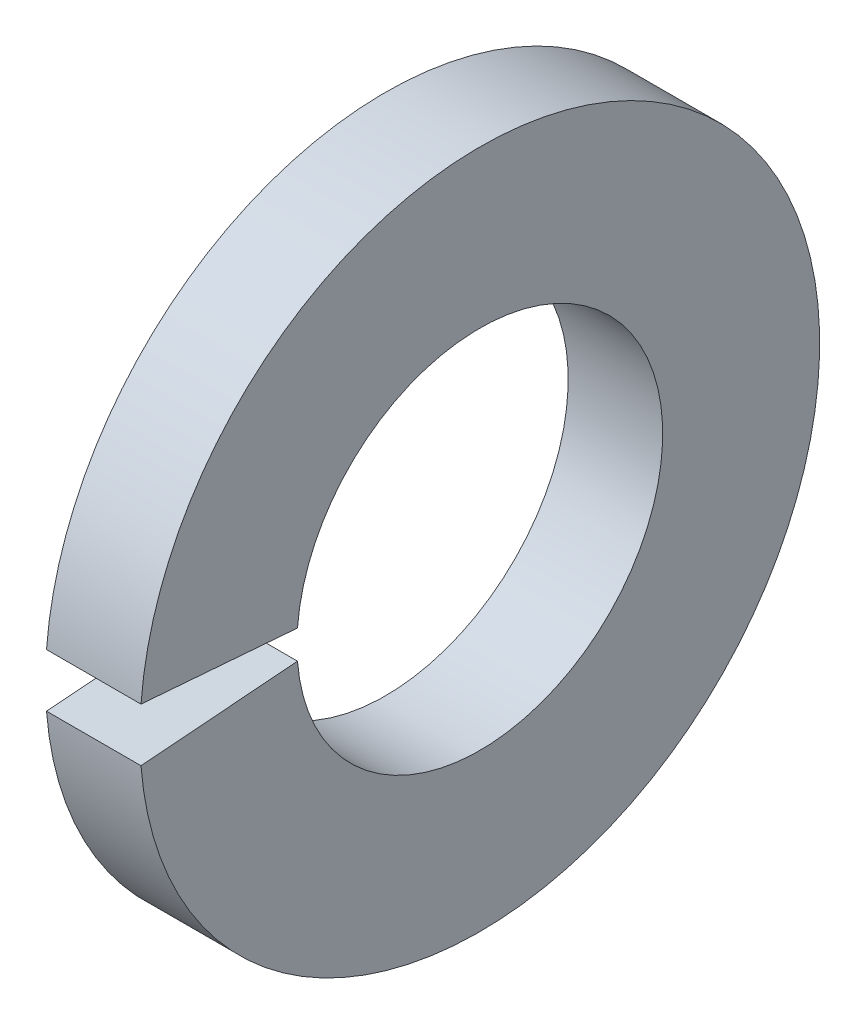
ISO-10303-21;
HEADER;
FILE_DESCRIPTION(('STEP AP214'),'2;1');
FILE_NAME('part.step','',(''),(''),'','','');
FILE_SCHEMA(('AUTOMOTIVE_DESIGN { 1 0 10303 214 1 1 1 1 }'));
ENDSEC;
DATA;
#1=APPLICATION_CONTEXT('core data for automotive mechanical design processes');
#2=APPLICATION_PROTOCOL_DEFINITION('international standard','automotive_design',2000,#1);
#3=PRODUCT_CONTEXT('',#1,'mechanical');
#4=PRODUCT('Part','Part','',(#3));
#5=PRODUCT_RELATED_PRODUCT_CATEGORY('part','',(#4));
#6=PRODUCT_DEFINITION_FORMATION('','',#4);
#7=PRODUCT_DEFINITION_CONTEXT('part definition',#1,'design');
#8=PRODUCT_DEFINITION('design','',#6,#7);
#9=PRODUCT_DEFINITION_SHAPE('','',#8);
#10=(LENGTH_UNIT() NAMED_UNIT(*) SI_UNIT(.MILLI.,.METRE.));
#11=(NAMED_UNIT(*) PLANE_ANGLE_UNIT() SI_UNIT($,.RADIAN.));
#12=(NAMED_UNIT(*) SI_UNIT($,.STERADIAN.) SOLID_ANGLE_UNIT());
#13=UNCERTAINTY_MEASURE_WITH_UNIT(LENGTH_MEASURE(1.E-05),#10,'distance_accuracy_value','');
#14=(GEOMETRIC_REPRESENTATION_CONTEXT(3) GLOBAL_UNCERTAINTY_ASSIGNED_CONTEXT((#13)) GLOBAL_UNIT_ASSIGNED_CONTEXT((#10,
#11,#12)) REPRESENTATION_CONTEXT('',''));
#15=CARTESIAN_POINT('',(0.,0.,0.));
#16=DIRECTION('',(0.,0.,1.));
#17=DIRECTION('',(1.,0.,0.));
#18=AXIS2_PLACEMENT_3D('',#15,#16,#17);
#19=CARTESIAN_POINT('',(-34.9249999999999,0.,0.));
#20=DIRECTION('',(-1.,0.,0.));
#21=DIRECTION('',(0.,0.,1.));
#22=AXIS2_PLACEMENT_3D('',#19,#20,#21);
#23=CYLINDRICAL_SURFACE('',#22,1.524);
#24=CARTESIAN_POINT('',(0.,0.,0.));
#25=DIRECTION('',(-1.,0.,0.));
#26=DIRECTION('',(0.,0.,1.));
#27=AXIS2_PLACEMENT_3D('',#24,#25,#26);
#28=CIRCLE('',#27,1.524);
#29=CARTESIAN_POINT('',(0.,0.119571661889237,1.51930201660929));
#30=VERTEX_POINT('',#29);
#31=CARTESIAN_POINT('',(0.,-0.119571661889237,1.51930201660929));
#32=VERTEX_POINT('',#31);
#33=EDGE_CURVE('E78',#30,#32,#28,.T.);
#34=ORIENTED_EDGE('',*,*,#33,.F.);
#35=DIRECTION('',(-1.,0.,0.));
#36=VECTOR('',#35,1.);
#37=CARTESIAN_POINT('',(-34.9249999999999,0.119571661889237,1.51930201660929));
#38=LINE('',#37,#36);
#39=CARTESIAN_POINT('',(-0.787400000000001,0.119571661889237,1.51930201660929));
#40=VERTEX_POINT('',#39);
#41=EDGE_CURVE('E44',#30,#40,#38,.T.);
#42=ORIENTED_EDGE('',*,*,#41,.T.);
#43=CARTESIAN_POINT('',(-0.787400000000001,0.,0.));
#44=DIRECTION('',(-1.,0.,0.));
#45=DIRECTION('',(0.,0.,1.));
#46=AXIS2_PLACEMENT_3D('',#43,#44,#45);
#47=CIRCLE('',#46,1.524);
#48=CARTESIAN_POINT('',(-0.787400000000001,-0.119571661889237,1.51930201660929));
#49=VERTEX_POINT('',#48);
#50=EDGE_CURVE('E74',#40,#49,#47,.T.);
#51=ORIENTED_EDGE('',*,*,#50,.T.);
#52=DIRECTION('',(-1.,0.,0.));
#53=VECTOR('',#52,1.);
#54=CARTESIAN_POINT('',(-34.9249999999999,-0.119571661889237,1.51930201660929));
#55=LINE('',#54,#53);
#56=EDGE_CURVE('E68',#32,#49,#55,.T.);
#57=ORIENTED_EDGE('',*,*,#56,.F.);
#58=EDGE_LOOP('',(#34,#42,#51,#57));
#59=FACE_BOUND('',#58,.T.);
#60=ADVANCED_FACE('F30',(#59),#23,.F.);
#61=CARTESIAN_POINT('',(-0.7874,2.8321,0.));
#62=DIRECTION('',(1.,0.,0.));
#63=DIRECTION('',(0.,0.,-1.));
#64=AXIS2_PLACEMENT_3D('',#61,#62,#63);
#65=PLANE('',#64);
#66=ORIENTED_EDGE('',*,*,#50,.F.);
#67=DIRECTION('',(0.,0.0784590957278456,0.996917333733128));
#68=VECTOR('',#67,1.);
#69=CARTESIAN_POINT('',(-0.787400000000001,0.,0.));
#70=LINE('',#69,#68);
#71=CARTESIAN_POINT('',(-0.787400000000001,0.222204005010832,2.82336958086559));
#72=VERTEX_POINT('',#71);
#73=EDGE_CURVE('E97',#40,#72,#70,.T.);
#74=ORIENTED_EDGE('',*,*,#73,.T.);
#75=CARTESIAN_POINT('',(-0.787400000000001,0.,0.));
#76=DIRECTION('',(-1.,0.,0.));
#77=DIRECTION('',(0.,0.,1.));
#78=AXIS2_PLACEMENT_3D('',#75,#76,#77);
#79=CIRCLE('',#78,2.8321);
#80=CARTESIAN_POINT('',(-0.787400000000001,-0.222204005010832,2.82336958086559));
#81=VERTEX_POINT('',#80);
#82=EDGE_CURVE('E85',#72,#81,#79,.T.);
#83=ORIENTED_EDGE('',*,*,#82,.T.);
#84=DIRECTION('',(0.,-0.0784590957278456,0.996917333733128));
#85=VECTOR('',#84,1.);
#86=CARTESIAN_POINT('',(-0.787400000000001,0.,0.));
#87=LINE('',#86,#85);
#88=EDGE_CURVE('E96',#49,#81,#87,.T.);
#89=ORIENTED_EDGE('',*,*,#88,.F.);
#90=EDGE_LOOP('',(#66,#74,#83,#89));
#91=FACE_BOUND('',#90,.T.);
#92=ADVANCED_FACE('F95',(#91),#65,.F.);
#93=CARTESIAN_POINT('',(-34.9249999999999,0.,0.));
#94=DIRECTION('',(-1.,0.,0.));
#95=DIRECTION('',(0.,0.,1.));
#96=AXIS2_PLACEMENT_3D('',#93,#94,#95);
#97=CYLINDRICAL_SURFACE('',#96,2.8321);
#98=ORIENTED_EDGE('',*,*,#82,.F.);
#99=DIRECTION('',(-1.,0.,0.));
#100=VECTOR('',#99,1.);
#101=CARTESIAN_POINT('',(-34.9249999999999,0.222204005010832,2.82336958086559));
#102=LINE('',#101,#100);
#103=CARTESIAN_POINT('',(0.,0.222204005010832,2.82336958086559));
#104=VERTEX_POINT('',#103);
#105=EDGE_CURVE('E80',#72,#104,#102,.F.);
#106=ORIENTED_EDGE('',*,*,#105,.T.);
#107=CARTESIAN_POINT('',(0.,0.,0.));
#108=DIRECTION('',(-1.,0.,0.));
#109=DIRECTION('',(0.,0.,1.));
#110=AXIS2_PLACEMENT_3D('',#107,#108,#109);
#111=CIRCLE('',#110,2.8321);
#112=CARTESIAN_POINT('',(0.,-0.222204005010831,2.82336958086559));
#113=VERTEX_POINT('',#112);
#114=EDGE_CURVE('E83',#104,#113,#111,.T.);
#115=ORIENTED_EDGE('',*,*,#114,.T.);
#116=DIRECTION('',(-1.,0.,0.));
#117=VECTOR('',#116,1.);
#118=CARTESIAN_POINT('',(-34.9249999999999,-0.222204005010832,2.82336958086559));
#119=LINE('',#118,#117);
#120=EDGE_CURVE('E51',#81,#113,#119,.F.);
#121=ORIENTED_EDGE('',*,*,#120,.F.);
#122=EDGE_LOOP('',(#98,#106,#115,#121));
#123=FACE_BOUND('',#122,.T.);
#124=ADVANCED_FACE('F100',(#123),#97,.T.);
#125=CARTESIAN_POINT('',(0.,1.524,0.));
#126=DIRECTION('',(-1.,0.,0.));
#127=DIRECTION('',(0.,0.,1.));
#128=AXIS2_PLACEMENT_3D('',#125,#126,#127);
#129=PLANE('',#128);
#130=ORIENTED_EDGE('',*,*,#114,.F.);
#131=DIRECTION('',(0.,-0.0784590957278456,-0.996917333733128));
#132=VECTOR('',#131,1.);
#133=CARTESIAN_POINT('',(0.,0.00938148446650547,0.119203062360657));
#134=LINE('',#133,#132);
#135=EDGE_CURVE('E11',#104,#30,#134,.T.);
#136=ORIENTED_EDGE('',*,*,#135,.T.);
#137=ORIENTED_EDGE('',*,*,#33,.T.);
#138=DIRECTION('',(0.,0.0784590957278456,-0.996917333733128));
#139=VECTOR('',#138,1.);
#140=CARTESIAN_POINT('',(0.,0.00938148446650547,-0.119203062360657));
#141=LINE('',#140,#139);
#142=EDGE_CURVE('E37',#113,#32,#141,.T.);
#143=ORIENTED_EDGE('',*,*,#142,.F.);
#144=EDGE_LOOP('',(#130,#136,#137,#143));
#145=FACE_BOUND('',#144,.T.);
#146=ADVANCED_FACE('F82',(#145),#129,.F.);
#147=CARTESIAN_POINT('',(-0.787400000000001,0.,0.));
#148=DIRECTION('',(0.,0.996917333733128,0.0784590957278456));
#149=DIRECTION('',(0.,-0.0784590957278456,0.996917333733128));
#150=AXIS2_PLACEMENT_3D('',#147,#148,#149);
#151=PLANE('',#150);
#152=ORIENTED_EDGE('',*,*,#56,.T.);
#153=ORIENTED_EDGE('',*,*,#88,.T.);
#154=ORIENTED_EDGE('',*,*,#120,.T.);
#155=ORIENTED_EDGE('',*,*,#142,.T.);
#156=EDGE_LOOP('',(#152,#153,#154,#155));
#157=FACE_BOUND('',#156,.T.);
#158=ADVANCED_FACE('F67',(#157),#151,.T.);
#159=CARTESIAN_POINT('',(-0.787400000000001,0.,0.));
#160=DIRECTION('',(0.,0.996917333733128,-0.0784590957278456));
#161=DIRECTION('',(0.,0.0784590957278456,0.996917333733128));
#162=AXIS2_PLACEMENT_3D('',#159,#160,#161);
#163=PLANE('',#162);
#164=ORIENTED_EDGE('',*,*,#135,.F.);
#165=ORIENTED_EDGE('',*,*,#105,.F.);
#166=ORIENTED_EDGE('',*,*,#73,.F.);
#167=ORIENTED_EDGE('',*,*,#41,.F.);
#168=EDGE_LOOP('',(#164,#165,#166,#167));
#169=FACE_BOUND('',#168,.T.);
#170=ADVANCED_FACE('F104',(#169),#163,.F.);
#171=CLOSED_SHELL('',(#60,#92,#124,#146,#158,#170));
#172=MANIFOLD_SOLID_BREP('B2',#171);
#173=ADVANCED_BREP_SHAPE_REPRESENTATION('',(#18,#172),#14);
#174=SHAPE_DEFINITION_REPRESENTATION(#9,#173);
ENDSEC;
END-ISO-10303-21;
